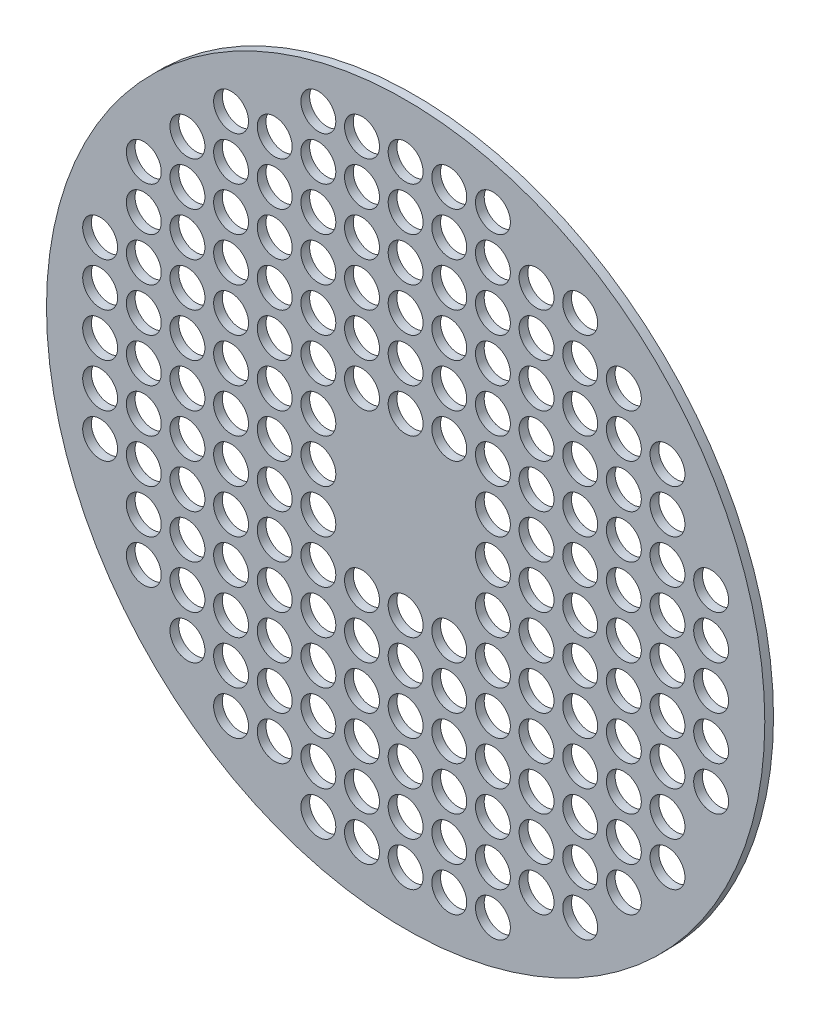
from build123d import *

# Parameters (mm, degrees)
SKETCH2_W                = 25.4
SKETCH2_H                = 25.4
EXTRUDE1_DEPTH           = 0.254
SKETCH3_R                = 0.508
CUT_EXTRUDE2_DEPTH       = 18.962308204
LPATTERN1_COUNT          = 8
LPATTERN1_PITCH          = 1.27
LPATTERN1_COUNT_DIR2     = 8
LPATTERN1_PITCH_DIR2     = 1.27
MIRROR1_COPY_1_SKETCH_R  = 0.508
MIRROR1_COPY_1_DEPTH     = 18.962308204
MIRROR1_COPY_2_SKETCH_R  = 0.508
MIRROR1_COPY_2_DEPTH     = 18.962308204
MIRROR1_COPY_3_SKETCH_R  = 0.508
MIRROR1_COPY_3_DEPTH     = 18.962308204
MIRROR1_COPY_4_SKETCH_R  = 0.508
MIRROR1_COPY_4_DEPTH     = 18.962308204
MIRROR1_COPY_5_SKETCH_R  = 0.508
MIRROR1_COPY_5_DEPTH     = 18.962308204
MIRROR1_COPY_6_SKETCH_R  = 0.508
MIRROR1_COPY_6_DEPTH     = 18.962308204
MIRROR1_COPY_7_SKETCH_R  = 0.508
MIRROR1_COPY_7_DEPTH     = 18.962308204
MIRROR1_COPY_8_SKETCH_R  = 0.508
MIRROR1_COPY_8_DEPTH     = 18.962308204
MIRROR1_COPY_9_SKETCH_R  = 0.508
MIRROR1_COPY_9_DEPTH     = 18.962308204
MIRROR1_COPY_10_SKETCH_R = 0.508
MIRROR1_COPY_10_DEPTH    = 18.962308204
MIRROR1_COPY_11_SKETCH_R = 0.508
MIRROR1_COPY_11_DEPTH    = 18.962308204
MIRROR1_COPY_12_SKETCH_R = 0.508
MIRROR1_COPY_12_DEPTH    = 18.962308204
MIRROR1_COPY_13_SKETCH_R = 0.508
MIRROR1_COPY_13_DEPTH    = 18.962308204
MIRROR1_COPY_14_SKETCH_R = 0.508
MIRROR1_COPY_14_DEPTH    = 18.962308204
MIRROR1_COPY_15_SKETCH_R = 0.508
MIRROR1_COPY_15_DEPTH    = 18.962308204
MIRROR1_COPY_16_SKETCH_R = 0.508
MIRROR1_COPY_16_DEPTH    = 18.962308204
MIRROR1_COPY_17_SKETCH_R = 0.508
MIRROR1_COPY_17_DEPTH    = 18.962308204
MIRROR1_COPY_18_SKETCH_R = 0.508
MIRROR1_COPY_18_DEPTH    = 18.962308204
MIRROR1_COPY_19_SKETCH_R = 0.508
MIRROR1_COPY_19_DEPTH    = 18.962308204
MIRROR1_COPY_20_SKETCH_R = 0.508
MIRROR1_COPY_20_DEPTH    = 18.962308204
MIRROR1_COPY_21_SKETCH_R = 0.508
MIRROR1_COPY_21_DEPTH    = 18.962308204
MIRROR1_COPY_22_SKETCH_R = 0.508
MIRROR1_COPY_22_DEPTH    = 18.962308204
MIRROR1_COPY_23_SKETCH_R = 0.508
MIRROR1_COPY_23_DEPTH    = 18.962308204
MIRROR1_COPY_24_SKETCH_R = 0.508
MIRROR1_COPY_24_DEPTH    = 18.962308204
MIRROR1_COPY_25_SKETCH_R = 0.508
MIRROR1_COPY_25_DEPTH    = 18.962308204
MIRROR1_COPY_26_SKETCH_R = 0.508
MIRROR1_COPY_26_DEPTH    = 18.962308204
MIRROR1_COPY_27_SKETCH_R = 0.508
MIRROR1_COPY_27_DEPTH    = 18.962308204
MIRROR1_COPY_28_SKETCH_R = 0.508
MIRROR1_COPY_28_DEPTH    = 18.962308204
MIRROR1_COPY_29_SKETCH_R = 0.508
MIRROR1_COPY_29_DEPTH    = 18.962308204
MIRROR1_COPY_30_SKETCH_R = 0.508
MIRROR1_COPY_30_DEPTH    = 18.962308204
MIRROR1_COPY_31_SKETCH_R = 0.508
MIRROR1_COPY_31_DEPTH    = 18.962308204
MIRROR1_COPY_32_SKETCH_R = 0.508
MIRROR1_COPY_32_DEPTH    = 18.962308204
MIRROR1_COPY_33_SKETCH_R = 0.508
MIRROR1_COPY_33_DEPTH    = 18.962308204
MIRROR1_COPY_34_SKETCH_R = 0.508
MIRROR1_COPY_34_DEPTH    = 18.962308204
MIRROR1_COPY_35_SKETCH_R = 0.508
MIRROR1_COPY_35_DEPTH    = 18.962308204
MIRROR1_COPY_36_SKETCH_R = 0.508
MIRROR1_COPY_36_DEPTH    = 18.962308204
MIRROR1_COPY_37_SKETCH_R = 0.508
MIRROR1_COPY_37_DEPTH    = 18.962308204
MIRROR1_COPY_38_SKETCH_R = 0.508
MIRROR1_COPY_38_DEPTH    = 18.962308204
MIRROR1_COPY_39_SKETCH_R = 0.508
MIRROR1_COPY_39_DEPTH    = 18.962308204
MIRROR1_COPY_40_SKETCH_R = 0.508
MIRROR1_COPY_40_DEPTH    = 18.962308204
MIRROR1_COPY_41_SKETCH_R = 0.508
MIRROR1_COPY_41_DEPTH    = 18.962308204
MIRROR1_COPY_42_SKETCH_R = 0.508
MIRROR1_COPY_42_DEPTH    = 18.962308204
MIRROR1_COPY_43_SKETCH_R = 0.508
MIRROR1_COPY_43_DEPTH    = 18.962308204
MIRROR1_COPY_44_SKETCH_R = 0.508
MIRROR1_COPY_44_DEPTH    = 18.962308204
MIRROR1_COPY_45_SKETCH_R = 0.508
MIRROR1_COPY_45_DEPTH    = 18.962308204
MIRROR1_COPY_46_SKETCH_R = 0.508
MIRROR1_COPY_46_DEPTH    = 18.962308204
MIRROR1_COPY_47_SKETCH_R = 0.508
MIRROR1_COPY_47_DEPTH    = 18.962308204
MIRROR1_COPY_48_SKETCH_R = 0.508
MIRROR1_COPY_48_DEPTH    = 18.962308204
MIRROR1_COPY_49_SKETCH_R = 0.508
MIRROR1_COPY_49_DEPTH    = 18.962308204
MIRROR2_COPY_1_SKETCH_R  = 0.508
MIRROR2_COPY_1_DEPTH     = 18.962308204
MIRROR2_COPY_2_SKETCH_R  = 0.508
MIRROR2_COPY_2_DEPTH     = 18.962308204
MIRROR2_COPY_3_SKETCH_R  = 0.508
MIRROR2_COPY_3_DEPTH     = 18.962308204
MIRROR2_COPY_4_SKETCH_R  = 0.508
MIRROR2_COPY_4_DEPTH     = 18.962308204
MIRROR2_COPY_5_SKETCH_R  = 0.508
MIRROR2_COPY_5_DEPTH     = 18.962308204
MIRROR2_COPY_6_SKETCH_R  = 0.508
MIRROR2_COPY_6_DEPTH     = 18.962308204
MIRROR2_COPY_7_SKETCH_R  = 0.508
MIRROR2_COPY_7_DEPTH     = 18.962308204
MIRROR2_COPY_8_SKETCH_R  = 0.508
MIRROR2_COPY_8_DEPTH     = 18.962308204
MIRROR2_COPY_9_SKETCH_R  = 0.508
MIRROR2_COPY_9_DEPTH     = 18.962308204
MIRROR2_COPY_10_SKETCH_R = 0.508
MIRROR2_COPY_10_DEPTH    = 18.962308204
MIRROR2_COPY_11_SKETCH_R = 0.508
MIRROR2_COPY_11_DEPTH    = 18.962308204
MIRROR2_COPY_12_SKETCH_R = 0.508
MIRROR2_COPY_12_DEPTH    = 18.962308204
MIRROR2_COPY_13_SKETCH_R = 0.508
MIRROR2_COPY_13_DEPTH    = 18.962308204
MIRROR2_COPY_14_SKETCH_R = 0.508
MIRROR2_COPY_14_DEPTH    = 18.962308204
MIRROR2_COPY_15_SKETCH_R = 0.508
MIRROR2_COPY_15_DEPTH    = 18.962308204
MIRROR2_COPY_16_SKETCH_R = 0.508
MIRROR2_COPY_16_DEPTH    = 18.962308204
MIRROR2_COPY_17_SKETCH_R = 0.508
MIRROR2_COPY_17_DEPTH    = 18.962308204
MIRROR2_COPY_18_SKETCH_R = 0.508
MIRROR2_COPY_18_DEPTH    = 18.962308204
MIRROR2_COPY_19_SKETCH_R = 0.508
MIRROR2_COPY_19_DEPTH    = 18.962308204
MIRROR2_COPY_20_SKETCH_R = 0.508
MIRROR2_COPY_20_DEPTH    = 18.962308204
MIRROR2_COPY_21_SKETCH_R = 0.508
MIRROR2_COPY_21_DEPTH    = 18.962308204
MIRROR2_COPY_22_SKETCH_R = 0.508
MIRROR2_COPY_22_DEPTH    = 18.962308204
MIRROR2_COPY_23_SKETCH_R = 0.508
MIRROR2_COPY_23_DEPTH    = 18.962308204
MIRROR2_COPY_24_SKETCH_R = 0.508
MIRROR2_COPY_24_DEPTH    = 18.962308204
MIRROR2_COPY_25_SKETCH_R = 0.508
MIRROR2_COPY_25_DEPTH    = 18.962308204
MIRROR2_COPY_26_SKETCH_R = 0.508
MIRROR2_COPY_26_DEPTH    = 18.962308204
MIRROR2_COPY_27_SKETCH_R = 0.508
MIRROR2_COPY_27_DEPTH    = 18.962308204
MIRROR2_COPY_28_SKETCH_R = 0.508
MIRROR2_COPY_28_DEPTH    = 18.962308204
MIRROR2_COPY_29_SKETCH_R = 0.508
MIRROR2_COPY_29_DEPTH    = 18.962308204
MIRROR2_COPY_30_SKETCH_R = 0.508
MIRROR2_COPY_30_DEPTH    = 18.962308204
MIRROR2_COPY_31_SKETCH_R = 0.508
MIRROR2_COPY_31_DEPTH    = 18.962308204
MIRROR2_COPY_32_SKETCH_R = 0.508
MIRROR2_COPY_32_DEPTH    = 18.962308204
MIRROR2_COPY_33_SKETCH_R = 0.508
MIRROR2_COPY_33_DEPTH    = 18.962308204
MIRROR2_COPY_34_SKETCH_R = 0.508
MIRROR2_COPY_34_DEPTH    = 18.962308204
MIRROR2_COPY_35_SKETCH_R = 0.508
MIRROR2_COPY_35_DEPTH    = 18.962308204
MIRROR2_COPY_36_SKETCH_R = 0.508
MIRROR2_COPY_36_DEPTH    = 18.962308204
MIRROR2_COPY_37_SKETCH_R = 0.508
MIRROR2_COPY_37_DEPTH    = 18.962308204
MIRROR2_COPY_38_SKETCH_R = 0.508
MIRROR2_COPY_38_DEPTH    = 18.962308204
MIRROR2_COPY_39_SKETCH_R = 0.508
MIRROR2_COPY_39_DEPTH    = 18.962308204
MIRROR2_COPY_40_SKETCH_R = 0.508
MIRROR2_COPY_40_DEPTH    = 18.962308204
MIRROR2_COPY_41_SKETCH_R = 0.508
MIRROR2_COPY_41_DEPTH    = 18.962308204
MIRROR2_COPY_42_SKETCH_R = 0.508
MIRROR2_COPY_42_DEPTH    = 18.962308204
MIRROR2_COPY_43_SKETCH_R = 0.508
MIRROR2_COPY_43_DEPTH    = 18.962308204
MIRROR2_COPY_44_SKETCH_R = 0.508
MIRROR2_COPY_44_DEPTH    = 18.962308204
MIRROR2_COPY_45_SKETCH_R = 0.508
MIRROR2_COPY_45_DEPTH    = 18.962308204
MIRROR2_COPY_46_SKETCH_R = 0.508
MIRROR2_COPY_46_DEPTH    = 18.962308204
MIRROR2_COPY_47_SKETCH_R = 0.508
MIRROR2_COPY_47_DEPTH    = 18.962308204
MIRROR2_COPY_48_SKETCH_R = 0.508
MIRROR2_COPY_48_DEPTH    = 18.962308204
MIRROR2_COPY_49_SKETCH_R = 0.508
MIRROR2_COPY_49_DEPTH    = 18.962308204
MIRROR2_COPY_50_SKETCH_R = 0.508
MIRROR2_COPY_50_DEPTH    = 18.962308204
MIRROR2_COPY_51_SKETCH_R = 0.508
MIRROR2_COPY_51_DEPTH    = 18.962308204
MIRROR2_COPY_52_SKETCH_R = 0.508
MIRROR2_COPY_52_DEPTH    = 18.962308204
MIRROR2_COPY_53_SKETCH_R = 0.508
MIRROR2_COPY_53_DEPTH    = 18.962308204
MIRROR2_COPY_54_SKETCH_R = 0.508
MIRROR2_COPY_54_DEPTH    = 18.962308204
MIRROR2_COPY_55_SKETCH_R = 0.508
MIRROR2_COPY_55_DEPTH    = 18.962308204
MIRROR2_COPY_56_SKETCH_R = 0.508
MIRROR2_COPY_56_DEPTH    = 18.962308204
MIRROR2_COPY_57_SKETCH_R = 0.508
MIRROR2_COPY_57_DEPTH    = 18.962308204
MIRROR2_COPY_58_SKETCH_R = 0.508
MIRROR2_COPY_58_DEPTH    = 18.962308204
MIRROR2_COPY_59_SKETCH_R = 0.508
MIRROR2_COPY_59_DEPTH    = 18.962308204
MIRROR2_COPY_60_SKETCH_R = 0.508
MIRROR2_COPY_60_DEPTH    = 18.962308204
MIRROR2_COPY_61_SKETCH_R = 0.508
MIRROR2_COPY_61_DEPTH    = 18.962308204
MIRROR2_COPY_62_SKETCH_R = 0.508
MIRROR2_COPY_62_DEPTH    = 18.962308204
MIRROR2_COPY_63_SKETCH_R = 0.508
MIRROR2_COPY_63_DEPTH    = 18.962308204
MIRROR2_COPY_64_SKETCH_R = 0.508
MIRROR2_COPY_64_DEPTH    = 18.962308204
MIRROR2_COPY_65_SKETCH_R = 0.508
MIRROR2_COPY_65_DEPTH    = 18.962308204
MIRROR2_COPY_66_SKETCH_R = 0.508
MIRROR2_COPY_66_DEPTH    = 18.962308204
MIRROR2_COPY_67_SKETCH_R = 0.508
MIRROR2_COPY_67_DEPTH    = 18.962308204
MIRROR2_COPY_68_SKETCH_R = 0.508
MIRROR2_COPY_68_DEPTH    = 18.962308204
MIRROR2_COPY_69_SKETCH_R = 0.508
MIRROR2_COPY_69_DEPTH    = 18.962308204
MIRROR2_COPY_70_SKETCH_R = 0.508
MIRROR2_COPY_70_DEPTH    = 18.962308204
MIRROR2_COPY_71_SKETCH_R = 0.508
MIRROR2_COPY_71_DEPTH    = 18.962308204
MIRROR2_COPY_72_SKETCH_R = 0.508
MIRROR2_COPY_72_DEPTH    = 18.962308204
MIRROR2_COPY_73_SKETCH_R = 0.508
MIRROR2_COPY_73_DEPTH    = 18.962308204
MIRROR2_COPY_74_SKETCH_R = 0.508
MIRROR2_COPY_74_DEPTH    = 18.962308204
MIRROR2_COPY_75_SKETCH_R = 0.508
MIRROR2_COPY_75_DEPTH    = 18.962308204
MIRROR2_COPY_76_SKETCH_R = 0.508
MIRROR2_COPY_76_DEPTH    = 18.962308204
MIRROR2_COPY_77_SKETCH_R = 0.508
MIRROR2_COPY_77_DEPTH    = 18.962308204
MIRROR2_COPY_78_SKETCH_R = 0.508
MIRROR2_COPY_78_DEPTH    = 18.962308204
MIRROR2_COPY_79_SKETCH_R = 0.508
MIRROR2_COPY_79_DEPTH    = 18.962308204
MIRROR2_COPY_80_SKETCH_R = 0.508
MIRROR2_COPY_80_DEPTH    = 18.962308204
MIRROR2_COPY_81_SKETCH_R = 0.508
MIRROR2_COPY_81_DEPTH    = 18.962308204
MIRROR2_COPY_82_SKETCH_R = 0.508
MIRROR2_COPY_82_DEPTH    = 18.962308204
MIRROR2_COPY_83_SKETCH_R = 0.508
MIRROR2_COPY_83_DEPTH    = 18.962308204
MIRROR2_COPY_84_SKETCH_R = 0.508
MIRROR2_COPY_84_DEPTH    = 18.962308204
MIRROR2_COPY_85_SKETCH_R = 0.508
MIRROR2_COPY_85_DEPTH    = 18.962308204
MIRROR2_COPY_86_SKETCH_R = 0.508
MIRROR2_COPY_86_DEPTH    = 18.962308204
MIRROR2_COPY_87_SKETCH_R = 0.508
MIRROR2_COPY_87_DEPTH    = 18.962308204
MIRROR2_COPY_88_SKETCH_R = 0.508
MIRROR2_COPY_88_DEPTH    = 18.962308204
MIRROR2_COPY_89_SKETCH_R = 0.508
MIRROR2_COPY_89_DEPTH    = 18.962308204
MIRROR2_COPY_90_SKETCH_R = 0.508
MIRROR2_COPY_90_DEPTH    = 18.962308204
MIRROR2_COPY_91_SKETCH_R = 0.508
MIRROR2_COPY_91_DEPTH    = 18.962308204
MIRROR2_COPY_92_SKETCH_R = 0.508
MIRROR2_COPY_92_DEPTH    = 18.962308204
MIRROR2_COPY_93_SKETCH_R = 0.508
MIRROR2_COPY_93_DEPTH    = 18.962308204
MIRROR2_COPY_94_SKETCH_R = 0.508
MIRROR2_COPY_94_DEPTH    = 18.962308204
MIRROR2_COPY_95_SKETCH_R = 0.508
MIRROR2_COPY_95_DEPTH    = 18.962308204
MIRROR2_COPY_96_SKETCH_R = 0.508
MIRROR2_COPY_96_DEPTH    = 18.962308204
MIRROR2_COPY_97_SKETCH_R = 0.508
MIRROR2_COPY_97_DEPTH    = 18.962308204
MIRROR2_COPY_98_SKETCH_R = 0.508
MIRROR2_COPY_98_DEPTH    = 18.962308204
MIRROR2_COPY_99_SKETCH_R = 0.508
MIRROR2_COPY_99_DEPTH    = 18.962308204
SKETCH4_OUTSIDE_W        = 34.584
SKETCH4_OUTSIDE_H        = 34.584
SKETCH4_OUTSIDE_R        = 10.4521
CUT_EXTRUDE4_DEPTH       = 18.962308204
SKETCH5_R                = 10.4521
SKETCH5_R_2              = 9.8298
EXTRUDE2_DEPTH           = 0.127
SKETCH6_R                = 1.905
EXTRUDE4_DEPTH           = 0.254


with BuildPart() as part:
    # Sketch2 → Extrude1 (new body)
    with BuildSketch(Plane.XY):
        Rectangle(SKETCH2_W, SKETCH2_H)
    extrude(amount=EXTRUDE1_DEPTH)

    # Sketch3 → Cut-Extrude2 (cut, through all)
    with BuildSketch(Plane.XY):
        Circle(SKETCH3_R)
    cut_extrude2 = extrude(amount=CUT_EXTRUDE2_DEPTH, mode=Mode.SUBTRACT)

    # LPattern1: Cut-Extrude2 8 × 8, 15 skipped
    with Locations(*[(-j * LPATTERN1_PITCH_DIR2, i * LPATTERN1_PITCH, 0) for i in range(LPATTERN1_COUNT) for j in range(LPATTERN1_COUNT_DIR2) if (i, j) not in ((0, 0), (0, 1), (1, 0), (1, 1), (3, 7), (4, 7), (5, 6), (5, 7), (6, 5), (6, 6), (6, 7), (7, 3), (7, 4), (7, 5), (7, 6), (7, 7))]):
        add(cut_extrude2, mode=Mode.SUBTRACT)

    # Mirror1 copy 1 sketch → Mirror1 copy 1 (cut, through all)
    with BuildSketch(Plane(origin=(-2.54, 0, 0), x_dir=(1, 0, 0), z_dir=(0, 0, 1))):
        Circle(MIRROR1_COPY_1_SKETCH_R)
    extrude(amount=MIRROR1_COPY_1_DEPTH, mode=Mode.SUBTRACT)

    # Mirror1 copy 2 sketch → Mirror1 copy 2 (cut, through all)
    with BuildSketch(Plane(origin=(-3.81, 0, 0), x_dir=(1, 0, 0), z_dir=(0, 0, 1))):
        Circle(MIRROR1_COPY_2_SKETCH_R)
    extrude(amount=MIRROR1_COPY_2_DEPTH, mode=Mode.SUBTRACT)

    # Mirror1 copy 3 sketch → Mirror1 copy 3 (cut, through all)
    with BuildSketch(Plane(origin=(-5.08, 0, 0), x_dir=(1, 0, 0), z_dir=(0, 0, 1))):
        Circle(MIRROR1_COPY_3_SKETCH_R)
    extrude(amount=MIRROR1_COPY_3_DEPTH, mode=Mode.SUBTRACT)

    # Mirror1 copy 4 sketch → Mirror1 copy 4 (cut, through all)
    with BuildSketch(Plane(origin=(-6.35, 0, 0), x_dir=(1, 0, 0), z_dir=(0, 0, 1))):
        Circle(MIRROR1_COPY_4_SKETCH_R)
    extrude(amount=MIRROR1_COPY_4_DEPTH, mode=Mode.SUBTRACT)

    # Mirror1 copy 5 sketch → Mirror1 copy 5 (cut, through all)
    with BuildSketch(Plane(origin=(-7.62, 0, 0), x_dir=(1, 0, 0), z_dir=(0, 0, 1))):
        Circle(MIRROR1_COPY_5_SKETCH_R)
    extrude(amount=MIRROR1_COPY_5_DEPTH, mode=Mode.SUBTRACT)

    # Mirror1 copy 6 sketch → Mirror1 copy 6 (cut, through all)
    with BuildSketch(Plane(origin=(-8.89, 0, 0), x_dir=(1, 0, 0), z_dir=(0, 0, 1))):
        Circle(MIRROR1_COPY_6_SKETCH_R)
    extrude(amount=MIRROR1_COPY_6_DEPTH, mode=Mode.SUBTRACT)

    # Mirror1 copy 7 sketch → Mirror1 copy 7 (cut, through all)
    with BuildSketch(Plane(origin=(-2.54, -1.27, 0), x_dir=(1, 0, 0), z_dir=(0, 0, 1))):
        Circle(MIRROR1_COPY_7_SKETCH_R)
    extrude(amount=MIRROR1_COPY_7_DEPTH, mode=Mode.SUBTRACT)

    # Mirror1 copy 8 sketch → Mirror1 copy 8 (cut, through all)
    with BuildSketch(Plane(origin=(-3.81, -1.27, 0), x_dir=(1, 0, 0), z_dir=(0, 0, 1))):
        Circle(MIRROR1_COPY_8_SKETCH_R)
    extrude(amount=MIRROR1_COPY_8_DEPTH, mode=Mode.SUBTRACT)

    # Mirror1 copy 9 sketch → Mirror1 copy 9 (cut, through all)
    with BuildSketch(Plane(origin=(-5.08, -1.27, 0), x_dir=(1, 0, 0), z_dir=(0, 0, 1))):
        Circle(MIRROR1_COPY_9_SKETCH_R)
    extrude(amount=MIRROR1_COPY_9_DEPTH, mode=Mode.SUBTRACT)

    # Mirror1 copy 10 sketch → Mirror1 copy 10 (cut, through all)
    with BuildSketch(Plane(origin=(-6.35, -1.27, 0), x_dir=(1, 0, 0), z_dir=(0, 0, 1))):
        Circle(MIRROR1_COPY_10_SKETCH_R)
    extrude(amount=MIRROR1_COPY_10_DEPTH, mode=Mode.SUBTRACT)

    # Mirror1 copy 11 sketch → Mirror1 copy 11 (cut, through all)
    with BuildSketch(Plane(origin=(-7.62, -1.27, 0), x_dir=(1, 0, 0), z_dir=(0, 0, 1))):
        Circle(MIRROR1_COPY_11_SKETCH_R)
    extrude(amount=MIRROR1_COPY_11_DEPTH, mode=Mode.SUBTRACT)

    # Mirror1 copy 12 sketch → Mirror1 copy 12 (cut, through all)
    with BuildSketch(Plane(origin=(-8.89, -1.27, 0), x_dir=(1, 0, 0), z_dir=(0, 0, 1))):
        Circle(MIRROR1_COPY_12_SKETCH_R)
    extrude(amount=MIRROR1_COPY_12_DEPTH, mode=Mode.SUBTRACT)

    # Mirror1 copy 13 sketch → Mirror1 copy 13 (cut, through all)
    with BuildSketch(Plane(origin=(0, -2.54, 0), x_dir=(1, 0, 0), z_dir=(0, 0, 1))):
        Circle(MIRROR1_COPY_13_SKETCH_R)
    extrude(amount=MIRROR1_COPY_13_DEPTH, mode=Mode.SUBTRACT)

    # Mirror1 copy 14 sketch → Mirror1 copy 14 (cut, through all)
    with BuildSketch(Plane(origin=(-1.27, -2.54, 0), x_dir=(1, 0, 0), z_dir=(0, 0, 1))):
        Circle(MIRROR1_COPY_14_SKETCH_R)
    extrude(amount=MIRROR1_COPY_14_DEPTH, mode=Mode.SUBTRACT)

    # Mirror1 copy 15 sketch → Mirror1 copy 15 (cut, through all)
    with BuildSketch(Plane(origin=(-2.54, -2.54, 0), x_dir=(1, 0, 0), z_dir=(0, 0, 1))):
        Circle(MIRROR1_COPY_15_SKETCH_R)
    extrude(amount=MIRROR1_COPY_15_DEPTH, mode=Mode.SUBTRACT)

    # Mirror1 copy 16 sketch → Mirror1 copy 16 (cut, through all)
    with BuildSketch(Plane(origin=(-3.81, -2.54, 0), x_dir=(1, 0, 0), z_dir=(0, 0, 1))):
        Circle(MIRROR1_COPY_16_SKETCH_R)
    extrude(amount=MIRROR1_COPY_16_DEPTH, mode=Mode.SUBTRACT)

    # Mirror1 copy 17 sketch → Mirror1 copy 17 (cut, through all)
    with BuildSketch(Plane(origin=(-5.08, -2.54, 0), x_dir=(1, 0, 0), z_dir=(0, 0, 1))):
        Circle(MIRROR1_COPY_17_SKETCH_R)
    extrude(amount=MIRROR1_COPY_17_DEPTH, mode=Mode.SUBTRACT)

    # Mirror1 copy 18 sketch → Mirror1 copy 18 (cut, through all)
    with BuildSketch(Plane(origin=(-6.35, -2.54, 0), x_dir=(1, 0, 0), z_dir=(0, 0, 1))):
        Circle(MIRROR1_COPY_18_SKETCH_R)
    extrude(amount=MIRROR1_COPY_18_DEPTH, mode=Mode.SUBTRACT)

    # Mirror1 copy 19 sketch → Mirror1 copy 19 (cut, through all)
    with BuildSketch(Plane(origin=(-7.62, -2.54, 0), x_dir=(1, 0, 0), z_dir=(0, 0, 1))):
        Circle(MIRROR1_COPY_19_SKETCH_R)
    extrude(amount=MIRROR1_COPY_19_DEPTH, mode=Mode.SUBTRACT)

    # Mirror1 copy 20 sketch → Mirror1 copy 20 (cut, through all)
    with BuildSketch(Plane(origin=(-8.89, -2.54, 0), x_dir=(1, 0, 0), z_dir=(0, 0, 1))):
        Circle(MIRROR1_COPY_20_SKETCH_R)
    extrude(amount=MIRROR1_COPY_20_DEPTH, mode=Mode.SUBTRACT)

    # Mirror1 copy 21 sketch → Mirror1 copy 21 (cut, through all)
    with BuildSketch(Plane(origin=(0, -3.81, 0), x_dir=(1, 0, 0), z_dir=(0, 0, 1))):
        Circle(MIRROR1_COPY_21_SKETCH_R)
    extrude(amount=MIRROR1_COPY_21_DEPTH, mode=Mode.SUBTRACT)

    # Mirror1 copy 22 sketch → Mirror1 copy 22 (cut, through all)
    with BuildSketch(Plane(origin=(-1.27, -3.81, 0), x_dir=(1, 0, 0), z_dir=(0, 0, 1))):
        Circle(MIRROR1_COPY_22_SKETCH_R)
    extrude(amount=MIRROR1_COPY_22_DEPTH, mode=Mode.SUBTRACT)

    # Mirror1 copy 23 sketch → Mirror1 copy 23 (cut, through all)
    with BuildSketch(Plane(origin=(-2.54, -3.81, 0), x_dir=(1, 0, 0), z_dir=(0, 0, 1))):
        Circle(MIRROR1_COPY_23_SKETCH_R)
    extrude(amount=MIRROR1_COPY_23_DEPTH, mode=Mode.SUBTRACT)

    # Mirror1 copy 24 sketch → Mirror1 copy 24 (cut, through all)
    with BuildSketch(Plane(origin=(-3.81, -3.81, 0), x_dir=(1, 0, 0), z_dir=(0, 0, 1))):
        Circle(MIRROR1_COPY_24_SKETCH_R)
    extrude(amount=MIRROR1_COPY_24_DEPTH, mode=Mode.SUBTRACT)

    # Mirror1 copy 25 sketch → Mirror1 copy 25 (cut, through all)
    with BuildSketch(Plane(origin=(-5.08, -3.81, 0), x_dir=(1, 0, 0), z_dir=(0, 0, 1))):
        Circle(MIRROR1_COPY_25_SKETCH_R)
    extrude(amount=MIRROR1_COPY_25_DEPTH, mode=Mode.SUBTRACT)

    # Mirror1 copy 26 sketch → Mirror1 copy 26 (cut, through all)
    with BuildSketch(Plane(origin=(-6.35, -3.81, 0), x_dir=(1, 0, 0), z_dir=(0, 0, 1))):
        Circle(MIRROR1_COPY_26_SKETCH_R)
    extrude(amount=MIRROR1_COPY_26_DEPTH, mode=Mode.SUBTRACT)

    # Mirror1 copy 27 sketch → Mirror1 copy 27 (cut, through all)
    with BuildSketch(Plane(origin=(-7.62, -3.81, 0), x_dir=(1, 0, 0), z_dir=(0, 0, 1))):
        Circle(MIRROR1_COPY_27_SKETCH_R)
    extrude(amount=MIRROR1_COPY_27_DEPTH, mode=Mode.SUBTRACT)

    # Mirror1 copy 28 sketch → Mirror1 copy 28 (cut, through all)
    with BuildSketch(Plane(origin=(0, -5.08, 0), x_dir=(1, 0, 0), z_dir=(0, 0, 1))):
        Circle(MIRROR1_COPY_28_SKETCH_R)
    extrude(amount=MIRROR1_COPY_28_DEPTH, mode=Mode.SUBTRACT)

    # Mirror1 copy 29 sketch → Mirror1 copy 29 (cut, through all)
    with BuildSketch(Plane(origin=(-1.27, -5.08, 0), x_dir=(1, 0, 0), z_dir=(0, 0, 1))):
        Circle(MIRROR1_COPY_29_SKETCH_R)
    extrude(amount=MIRROR1_COPY_29_DEPTH, mode=Mode.SUBTRACT)

    # Mirror1 copy 30 sketch → Mirror1 copy 30 (cut, through all)
    with BuildSketch(Plane(origin=(-2.54, -5.08, 0), x_dir=(1, 0, 0), z_dir=(0, 0, 1))):
        Circle(MIRROR1_COPY_30_SKETCH_R)
    extrude(amount=MIRROR1_COPY_30_DEPTH, mode=Mode.SUBTRACT)

    # Mirror1 copy 31 sketch → Mirror1 copy 31 (cut, through all)
    with BuildSketch(Plane(origin=(-3.81, -5.08, 0), x_dir=(1, 0, 0), z_dir=(0, 0, 1))):
        Circle(MIRROR1_COPY_31_SKETCH_R)
    extrude(amount=MIRROR1_COPY_31_DEPTH, mode=Mode.SUBTRACT)

    # Mirror1 copy 32 sketch → Mirror1 copy 32 (cut, through all)
    with BuildSketch(Plane(origin=(-5.08, -5.08, 0), x_dir=(1, 0, 0), z_dir=(0, 0, 1))):
        Circle(MIRROR1_COPY_32_SKETCH_R)
    extrude(amount=MIRROR1_COPY_32_DEPTH, mode=Mode.SUBTRACT)

    # Mirror1 copy 33 sketch → Mirror1 copy 33 (cut, through all)
    with BuildSketch(Plane(origin=(-6.35, -5.08, 0), x_dir=(1, 0, 0), z_dir=(0, 0, 1))):
        Circle(MIRROR1_COPY_33_SKETCH_R)
    extrude(amount=MIRROR1_COPY_33_DEPTH, mode=Mode.SUBTRACT)

    # Mirror1 copy 34 sketch → Mirror1 copy 34 (cut, through all)
    with BuildSketch(Plane(origin=(-7.62, -5.08, 0), x_dir=(1, 0, 0), z_dir=(0, 0, 1))):
        Circle(MIRROR1_COPY_34_SKETCH_R)
    extrude(amount=MIRROR1_COPY_34_DEPTH, mode=Mode.SUBTRACT)

    # Mirror1 copy 35 sketch → Mirror1 copy 35 (cut, through all)
    with BuildSketch(Plane(origin=(0, -6.35, 0), x_dir=(1, 0, 0), z_dir=(0, 0, 1))):
        Circle(MIRROR1_COPY_35_SKETCH_R)
    extrude(amount=MIRROR1_COPY_35_DEPTH, mode=Mode.SUBTRACT)

    # Mirror1 copy 36 sketch → Mirror1 copy 36 (cut, through all)
    with BuildSketch(Plane(origin=(-1.27, -6.35, 0), x_dir=(1, 0, 0), z_dir=(0, 0, 1))):
        Circle(MIRROR1_COPY_36_SKETCH_R)
    extrude(amount=MIRROR1_COPY_36_DEPTH, mode=Mode.SUBTRACT)

    # Mirror1 copy 37 sketch → Mirror1 copy 37 (cut, through all)
    with BuildSketch(Plane(origin=(-2.54, -6.35, 0), x_dir=(1, 0, 0), z_dir=(0, 0, 1))):
        Circle(MIRROR1_COPY_37_SKETCH_R)
    extrude(amount=MIRROR1_COPY_37_DEPTH, mode=Mode.SUBTRACT)

    # Mirror1 copy 38 sketch → Mirror1 copy 38 (cut, through all)
    with BuildSketch(Plane(origin=(-3.81, -6.35, 0), x_dir=(1, 0, 0), z_dir=(0, 0, 1))):
        Circle(MIRROR1_COPY_38_SKETCH_R)
    extrude(amount=MIRROR1_COPY_38_DEPTH, mode=Mode.SUBTRACT)

    # Mirror1 copy 39 sketch → Mirror1 copy 39 (cut, through all)
    with BuildSketch(Plane(origin=(-5.08, -6.35, 0), x_dir=(1, 0, 0), z_dir=(0, 0, 1))):
        Circle(MIRROR1_COPY_39_SKETCH_R)
    extrude(amount=MIRROR1_COPY_39_DEPTH, mode=Mode.SUBTRACT)

    # Mirror1 copy 40 sketch → Mirror1 copy 40 (cut, through all)
    with BuildSketch(Plane(origin=(-6.35, -6.35, 0), x_dir=(1, 0, 0), z_dir=(0, 0, 1))):
        Circle(MIRROR1_COPY_40_SKETCH_R)
    extrude(amount=MIRROR1_COPY_40_DEPTH, mode=Mode.SUBTRACT)

    # Mirror1 copy 41 sketch → Mirror1 copy 41 (cut, through all)
    with BuildSketch(Plane(origin=(0, -7.62, 0), x_dir=(1, 0, 0), z_dir=(0, 0, 1))):
        Circle(MIRROR1_COPY_41_SKETCH_R)
    extrude(amount=MIRROR1_COPY_41_DEPTH, mode=Mode.SUBTRACT)

    # Mirror1 copy 42 sketch → Mirror1 copy 42 (cut, through all)
    with BuildSketch(Plane(origin=(-1.27, -7.62, 0), x_dir=(1, 0, 0), z_dir=(0, 0, 1))):
        Circle(MIRROR1_COPY_42_SKETCH_R)
    extrude(amount=MIRROR1_COPY_42_DEPTH, mode=Mode.SUBTRACT)

    # Mirror1 copy 43 sketch → Mirror1 copy 43 (cut, through all)
    with BuildSketch(Plane(origin=(-2.54, -7.62, 0), x_dir=(1, 0, 0), z_dir=(0, 0, 1))):
        Circle(MIRROR1_COPY_43_SKETCH_R)
    extrude(amount=MIRROR1_COPY_43_DEPTH, mode=Mode.SUBTRACT)

    # Mirror1 copy 44 sketch → Mirror1 copy 44 (cut, through all)
    with BuildSketch(Plane(origin=(-3.81, -7.62, 0), x_dir=(1, 0, 0), z_dir=(0, 0, 1))):
        Circle(MIRROR1_COPY_44_SKETCH_R)
    extrude(amount=MIRROR1_COPY_44_DEPTH, mode=Mode.SUBTRACT)

    # Mirror1 copy 45 sketch → Mirror1 copy 45 (cut, through all)
    with BuildSketch(Plane(origin=(-5.08, -7.62, 0), x_dir=(1, 0, 0), z_dir=(0, 0, 1))):
        Circle(MIRROR1_COPY_45_SKETCH_R)
    extrude(amount=MIRROR1_COPY_45_DEPTH, mode=Mode.SUBTRACT)

    # Mirror1 copy 46 sketch → Mirror1 copy 46 (cut, through all)
    with BuildSketch(Plane(origin=(0, -8.89, 0), x_dir=(1, 0, 0), z_dir=(0, 0, 1))):
        Circle(MIRROR1_COPY_46_SKETCH_R)
    extrude(amount=MIRROR1_COPY_46_DEPTH, mode=Mode.SUBTRACT)

    # Mirror1 copy 47 sketch → Mirror1 copy 47 (cut, through all)
    with BuildSketch(Plane(origin=(-1.27, -8.89, 0), x_dir=(1, 0, 0), z_dir=(0, 0, 1))):
        Circle(MIRROR1_COPY_47_SKETCH_R)
    extrude(amount=MIRROR1_COPY_47_DEPTH, mode=Mode.SUBTRACT)

    # Mirror1 copy 48 sketch → Mirror1 copy 48 (cut, through all)
    with BuildSketch(Plane(origin=(-2.54, -8.89, 0), x_dir=(1, 0, 0), z_dir=(0, 0, 1))):
        Circle(MIRROR1_COPY_48_SKETCH_R)
    extrude(amount=MIRROR1_COPY_48_DEPTH, mode=Mode.SUBTRACT)

    # Mirror1 copy 49 sketch → Mirror1 copy 49 (cut, through all)
    with BuildSketch(Plane.XY):
        Circle(MIRROR1_COPY_49_SKETCH_R)
    extrude(amount=MIRROR1_COPY_49_DEPTH, mode=Mode.SUBTRACT)

    # Mirror2 copy 1 sketch → Mirror2 copy 1 (cut, through all)
    with BuildSketch(Plane(origin=(2.54, 0, 0), x_dir=(-1, 0, 0), z_dir=(0, 0, 1))):
        Circle(MIRROR2_COPY_1_SKETCH_R)
    extrude(amount=MIRROR2_COPY_1_DEPTH, mode=Mode.SUBTRACT)

    # Mirror2 copy 2 sketch → Mirror2 copy 2 (cut, through all)
    with BuildSketch(Plane(origin=(3.81, 0, 0), x_dir=(-1, 0, 0), z_dir=(0, 0, 1))):
        Circle(MIRROR2_COPY_2_SKETCH_R)
    extrude(amount=MIRROR2_COPY_2_DEPTH, mode=Mode.SUBTRACT)

    # Mirror2 copy 3 sketch → Mirror2 copy 3 (cut, through all)
    with BuildSketch(Plane(origin=(5.08, 0, 0), x_dir=(-1, 0, 0), z_dir=(0, 0, 1))):
        Circle(MIRROR2_COPY_3_SKETCH_R)
    extrude(amount=MIRROR2_COPY_3_DEPTH, mode=Mode.SUBTRACT)

    # Mirror2 copy 4 sketch → Mirror2 copy 4 (cut, through all)
    with BuildSketch(Plane(origin=(6.35, 0, 0), x_dir=(-1, 0, 0), z_dir=(0, 0, 1))):
        Circle(MIRROR2_COPY_4_SKETCH_R)
    extrude(amount=MIRROR2_COPY_4_DEPTH, mode=Mode.SUBTRACT)

    # Mirror2 copy 5 sketch → Mirror2 copy 5 (cut, through all)
    with BuildSketch(Plane(origin=(7.62, 0, 0), x_dir=(-1, 0, 0), z_dir=(0, 0, 1))):
        Circle(MIRROR2_COPY_5_SKETCH_R)
    extrude(amount=MIRROR2_COPY_5_DEPTH, mode=Mode.SUBTRACT)

    # Mirror2 copy 6 sketch → Mirror2 copy 6 (cut, through all)
    with BuildSketch(Plane(origin=(8.89, 0, 0), x_dir=(-1, 0, 0), z_dir=(0, 0, 1))):
        Circle(MIRROR2_COPY_6_SKETCH_R)
    extrude(amount=MIRROR2_COPY_6_DEPTH, mode=Mode.SUBTRACT)

    # Mirror2 copy 7 sketch → Mirror2 copy 7 (cut, through all)
    with BuildSketch(Plane(origin=(2.54, 1.27, 0), x_dir=(-1, 0, 0), z_dir=(0, 0, 1))):
        Circle(MIRROR2_COPY_7_SKETCH_R)
    extrude(amount=MIRROR2_COPY_7_DEPTH, mode=Mode.SUBTRACT)

    # Mirror2 copy 8 sketch → Mirror2 copy 8 (cut, through all)
    with BuildSketch(Plane(origin=(3.81, 1.27, 0), x_dir=(-1, 0, 0), z_dir=(0, 0, 1))):
        Circle(MIRROR2_COPY_8_SKETCH_R)
    extrude(amount=MIRROR2_COPY_8_DEPTH, mode=Mode.SUBTRACT)

    # Mirror2 copy 9 sketch → Mirror2 copy 9 (cut, through all)
    with BuildSketch(Plane(origin=(5.08, 1.27, 0), x_dir=(-1, 0, 0), z_dir=(0, 0, 1))):
        Circle(MIRROR2_COPY_9_SKETCH_R)
    extrude(amount=MIRROR2_COPY_9_DEPTH, mode=Mode.SUBTRACT)

    # Mirror2 copy 10 sketch → Mirror2 copy 10 (cut, through all)
    with BuildSketch(Plane(origin=(6.35, 1.27, 0), x_dir=(-1, 0, 0), z_dir=(0, 0, 1))):
        Circle(MIRROR2_COPY_10_SKETCH_R)
    extrude(amount=MIRROR2_COPY_10_DEPTH, mode=Mode.SUBTRACT)

    # Mirror2 copy 11 sketch → Mirror2 copy 11 (cut, through all)
    with BuildSketch(Plane(origin=(7.62, 1.27, 0), x_dir=(-1, 0, 0), z_dir=(0, 0, 1))):
        Circle(MIRROR2_COPY_11_SKETCH_R)
    extrude(amount=MIRROR2_COPY_11_DEPTH, mode=Mode.SUBTRACT)

    # Mirror2 copy 12 sketch → Mirror2 copy 12 (cut, through all)
    with BuildSketch(Plane(origin=(8.89, 1.27, 0), x_dir=(-1, 0, 0), z_dir=(0, 0, 1))):
        Circle(MIRROR2_COPY_12_SKETCH_R)
    extrude(amount=MIRROR2_COPY_12_DEPTH, mode=Mode.SUBTRACT)

    # Mirror2 copy 13 sketch → Mirror2 copy 13 (cut, through all)
    with BuildSketch(Plane(origin=(0, 2.54, 0), x_dir=(-1, 0, 0), z_dir=(0, 0, 1))):
        Circle(MIRROR2_COPY_13_SKETCH_R)
    extrude(amount=MIRROR2_COPY_13_DEPTH, mode=Mode.SUBTRACT)

    # Mirror2 copy 14 sketch → Mirror2 copy 14 (cut, through all)
    with BuildSketch(Plane(origin=(1.27, 2.54, 0), x_dir=(-1, 0, 0), z_dir=(0, 0, 1))):
        Circle(MIRROR2_COPY_14_SKETCH_R)
    extrude(amount=MIRROR2_COPY_14_DEPTH, mode=Mode.SUBTRACT)

    # Mirror2 copy 15 sketch → Mirror2 copy 15 (cut, through all)
    with BuildSketch(Plane(origin=(2.54, 2.54, 0), x_dir=(-1, 0, 0), z_dir=(0, 0, 1))):
        Circle(MIRROR2_COPY_15_SKETCH_R)
    extrude(amount=MIRROR2_COPY_15_DEPTH, mode=Mode.SUBTRACT)

    # Mirror2 copy 16 sketch → Mirror2 copy 16 (cut, through all)
    with BuildSketch(Plane(origin=(3.81, 2.54, 0), x_dir=(-1, 0, 0), z_dir=(0, 0, 1))):
        Circle(MIRROR2_COPY_16_SKETCH_R)
    extrude(amount=MIRROR2_COPY_16_DEPTH, mode=Mode.SUBTRACT)

    # Mirror2 copy 17 sketch → Mirror2 copy 17 (cut, through all)
    with BuildSketch(Plane(origin=(5.08, 2.54, 0), x_dir=(-1, 0, 0), z_dir=(0, 0, 1))):
        Circle(MIRROR2_COPY_17_SKETCH_R)
    extrude(amount=MIRROR2_COPY_17_DEPTH, mode=Mode.SUBTRACT)

    # Mirror2 copy 18 sketch → Mirror2 copy 18 (cut, through all)
    with BuildSketch(Plane(origin=(6.35, 2.54, 0), x_dir=(-1, 0, 0), z_dir=(0, 0, 1))):
        Circle(MIRROR2_COPY_18_SKETCH_R)
    extrude(amount=MIRROR2_COPY_18_DEPTH, mode=Mode.SUBTRACT)

    # Mirror2 copy 19 sketch → Mirror2 copy 19 (cut, through all)
    with BuildSketch(Plane(origin=(7.62, 2.54, 0), x_dir=(-1, 0, 0), z_dir=(0, 0, 1))):
        Circle(MIRROR2_COPY_19_SKETCH_R)
    extrude(amount=MIRROR2_COPY_19_DEPTH, mode=Mode.SUBTRACT)

    # Mirror2 copy 20 sketch → Mirror2 copy 20 (cut, through all)
    with BuildSketch(Plane(origin=(8.89, 2.54, 0), x_dir=(-1, 0, 0), z_dir=(0, 0, 1))):
        Circle(MIRROR2_COPY_20_SKETCH_R)
    extrude(amount=MIRROR2_COPY_20_DEPTH, mode=Mode.SUBTRACT)

    # Mirror2 copy 21 sketch → Mirror2 copy 21 (cut, through all)
    with BuildSketch(Plane(origin=(0, 3.81, 0), x_dir=(-1, 0, 0), z_dir=(0, 0, 1))):
        Circle(MIRROR2_COPY_21_SKETCH_R)
    extrude(amount=MIRROR2_COPY_21_DEPTH, mode=Mode.SUBTRACT)

    # Mirror2 copy 22 sketch → Mirror2 copy 22 (cut, through all)
    with BuildSketch(Plane(origin=(1.27, 3.81, 0), x_dir=(-1, 0, 0), z_dir=(0, 0, 1))):
        Circle(MIRROR2_COPY_22_SKETCH_R)
    extrude(amount=MIRROR2_COPY_22_DEPTH, mode=Mode.SUBTRACT)

    # Mirror2 copy 23 sketch → Mirror2 copy 23 (cut, through all)
    with BuildSketch(Plane(origin=(2.54, 3.81, 0), x_dir=(-1, 0, 0), z_dir=(0, 0, 1))):
        Circle(MIRROR2_COPY_23_SKETCH_R)
    extrude(amount=MIRROR2_COPY_23_DEPTH, mode=Mode.SUBTRACT)

    # Mirror2 copy 24 sketch → Mirror2 copy 24 (cut, through all)
    with BuildSketch(Plane(origin=(3.81, 3.81, 0), x_dir=(-1, 0, 0), z_dir=(0, 0, 1))):
        Circle(MIRROR2_COPY_24_SKETCH_R)
    extrude(amount=MIRROR2_COPY_24_DEPTH, mode=Mode.SUBTRACT)

    # Mirror2 copy 25 sketch → Mirror2 copy 25 (cut, through all)
    with BuildSketch(Plane(origin=(5.08, 3.81, 0), x_dir=(-1, 0, 0), z_dir=(0, 0, 1))):
        Circle(MIRROR2_COPY_25_SKETCH_R)
    extrude(amount=MIRROR2_COPY_25_DEPTH, mode=Mode.SUBTRACT)

    # Mirror2 copy 26 sketch → Mirror2 copy 26 (cut, through all)
    with BuildSketch(Plane(origin=(6.35, 3.81, 0), x_dir=(-1, 0, 0), z_dir=(0, 0, 1))):
        Circle(MIRROR2_COPY_26_SKETCH_R)
    extrude(amount=MIRROR2_COPY_26_DEPTH, mode=Mode.SUBTRACT)

    # Mirror2 copy 27 sketch → Mirror2 copy 27 (cut, through all)
    with BuildSketch(Plane(origin=(7.62, 3.81, 0), x_dir=(-1, 0, 0), z_dir=(0, 0, 1))):
        Circle(MIRROR2_COPY_27_SKETCH_R)
    extrude(amount=MIRROR2_COPY_27_DEPTH, mode=Mode.SUBTRACT)

    # Mirror2 copy 28 sketch → Mirror2 copy 28 (cut, through all)
    with BuildSketch(Plane(origin=(0, 5.08, 0), x_dir=(-1, 0, 0), z_dir=(0, 0, 1))):
        Circle(MIRROR2_COPY_28_SKETCH_R)
    extrude(amount=MIRROR2_COPY_28_DEPTH, mode=Mode.SUBTRACT)

    # Mirror2 copy 29 sketch → Mirror2 copy 29 (cut, through all)
    with BuildSketch(Plane(origin=(1.27, 5.08, 0), x_dir=(-1, 0, 0), z_dir=(0, 0, 1))):
        Circle(MIRROR2_COPY_29_SKETCH_R)
    extrude(amount=MIRROR2_COPY_29_DEPTH, mode=Mode.SUBTRACT)

    # Mirror2 copy 30 sketch → Mirror2 copy 30 (cut, through all)
    with BuildSketch(Plane(origin=(2.54, 5.08, 0), x_dir=(-1, 0, 0), z_dir=(0, 0, 1))):
        Circle(MIRROR2_COPY_30_SKETCH_R)
    extrude(amount=MIRROR2_COPY_30_DEPTH, mode=Mode.SUBTRACT)

    # Mirror2 copy 31 sketch → Mirror2 copy 31 (cut, through all)
    with BuildSketch(Plane(origin=(3.81, 5.08, 0), x_dir=(-1, 0, 0), z_dir=(0, 0, 1))):
        Circle(MIRROR2_COPY_31_SKETCH_R)
    extrude(amount=MIRROR2_COPY_31_DEPTH, mode=Mode.SUBTRACT)

    # Mirror2 copy 32 sketch → Mirror2 copy 32 (cut, through all)
    with BuildSketch(Plane(origin=(5.08, 5.08, 0), x_dir=(-1, 0, 0), z_dir=(0, 0, 1))):
        Circle(MIRROR2_COPY_32_SKETCH_R)
    extrude(amount=MIRROR2_COPY_32_DEPTH, mode=Mode.SUBTRACT)

    # Mirror2 copy 33 sketch → Mirror2 copy 33 (cut, through all)
    with BuildSketch(Plane(origin=(6.35, 5.08, 0), x_dir=(-1, 0, 0), z_dir=(0, 0, 1))):
        Circle(MIRROR2_COPY_33_SKETCH_R)
    extrude(amount=MIRROR2_COPY_33_DEPTH, mode=Mode.SUBTRACT)

    # Mirror2 copy 34 sketch → Mirror2 copy 34 (cut, through all)
    with BuildSketch(Plane(origin=(7.62, 5.08, 0), x_dir=(-1, 0, 0), z_dir=(0, 0, 1))):
        Circle(MIRROR2_COPY_34_SKETCH_R)
    extrude(amount=MIRROR2_COPY_34_DEPTH, mode=Mode.SUBTRACT)

    # Mirror2 copy 35 sketch → Mirror2 copy 35 (cut, through all)
    with BuildSketch(Plane(origin=(0, 6.35, 0), x_dir=(-1, 0, 0), z_dir=(0, 0, 1))):
        Circle(MIRROR2_COPY_35_SKETCH_R)
    extrude(amount=MIRROR2_COPY_35_DEPTH, mode=Mode.SUBTRACT)

    # Mirror2 copy 36 sketch → Mirror2 copy 36 (cut, through all)
    with BuildSketch(Plane(origin=(1.27, 6.35, 0), x_dir=(-1, 0, 0), z_dir=(0, 0, 1))):
        Circle(MIRROR2_COPY_36_SKETCH_R)
    extrude(amount=MIRROR2_COPY_36_DEPTH, mode=Mode.SUBTRACT)

    # Mirror2 copy 37 sketch → Mirror2 copy 37 (cut, through all)
    with BuildSketch(Plane(origin=(2.54, 6.35, 0), x_dir=(-1, 0, 0), z_dir=(0, 0, 1))):
        Circle(MIRROR2_COPY_37_SKETCH_R)
    extrude(amount=MIRROR2_COPY_37_DEPTH, mode=Mode.SUBTRACT)

    # Mirror2 copy 38 sketch → Mirror2 copy 38 (cut, through all)
    with BuildSketch(Plane(origin=(3.81, 6.35, 0), x_dir=(-1, 0, 0), z_dir=(0, 0, 1))):
        Circle(MIRROR2_COPY_38_SKETCH_R)
    extrude(amount=MIRROR2_COPY_38_DEPTH, mode=Mode.SUBTRACT)

    # Mirror2 copy 39 sketch → Mirror2 copy 39 (cut, through all)
    with BuildSketch(Plane(origin=(5.08, 6.35, 0), x_dir=(-1, 0, 0), z_dir=(0, 0, 1))):
        Circle(MIRROR2_COPY_39_SKETCH_R)
    extrude(amount=MIRROR2_COPY_39_DEPTH, mode=Mode.SUBTRACT)

    # Mirror2 copy 40 sketch → Mirror2 copy 40 (cut, through all)
    with BuildSketch(Plane(origin=(6.35, 6.35, 0), x_dir=(-1, 0, 0), z_dir=(0, 0, 1))):
        Circle(MIRROR2_COPY_40_SKETCH_R)
    extrude(amount=MIRROR2_COPY_40_DEPTH, mode=Mode.SUBTRACT)

    # Mirror2 copy 41 sketch → Mirror2 copy 41 (cut, through all)
    with BuildSketch(Plane(origin=(0, 7.62, 0), x_dir=(-1, 0, 0), z_dir=(0, 0, 1))):
        Circle(MIRROR2_COPY_41_SKETCH_R)
    extrude(amount=MIRROR2_COPY_41_DEPTH, mode=Mode.SUBTRACT)

    # Mirror2 copy 42 sketch → Mirror2 copy 42 (cut, through all)
    with BuildSketch(Plane(origin=(1.27, 7.62, 0), x_dir=(-1, 0, 0), z_dir=(0, 0, 1))):
        Circle(MIRROR2_COPY_42_SKETCH_R)
    extrude(amount=MIRROR2_COPY_42_DEPTH, mode=Mode.SUBTRACT)

    # Mirror2 copy 43 sketch → Mirror2 copy 43 (cut, through all)
    with BuildSketch(Plane(origin=(2.54, 7.62, 0), x_dir=(-1, 0, 0), z_dir=(0, 0, 1))):
        Circle(MIRROR2_COPY_43_SKETCH_R)
    extrude(amount=MIRROR2_COPY_43_DEPTH, mode=Mode.SUBTRACT)

    # Mirror2 copy 44 sketch → Mirror2 copy 44 (cut, through all)
    with BuildSketch(Plane(origin=(3.81, 7.62, 0), x_dir=(-1, 0, 0), z_dir=(0, 0, 1))):
        Circle(MIRROR2_COPY_44_SKETCH_R)
    extrude(amount=MIRROR2_COPY_44_DEPTH, mode=Mode.SUBTRACT)

    # Mirror2 copy 45 sketch → Mirror2 copy 45 (cut, through all)
    with BuildSketch(Plane(origin=(5.08, 7.62, 0), x_dir=(-1, 0, 0), z_dir=(0, 0, 1))):
        Circle(MIRROR2_COPY_45_SKETCH_R)
    extrude(amount=MIRROR2_COPY_45_DEPTH, mode=Mode.SUBTRACT)

    # Mirror2 copy 46 sketch → Mirror2 copy 46 (cut, through all)
    with BuildSketch(Plane(origin=(0, 8.89, 0), x_dir=(-1, 0, 0), z_dir=(0, 0, 1))):
        Circle(MIRROR2_COPY_46_SKETCH_R)
    extrude(amount=MIRROR2_COPY_46_DEPTH, mode=Mode.SUBTRACT)

    # Mirror2 copy 47 sketch → Mirror2 copy 47 (cut, through all)
    with BuildSketch(Plane(origin=(1.27, 8.89, 0), x_dir=(-1, 0, 0), z_dir=(0, 0, 1))):
        Circle(MIRROR2_COPY_47_SKETCH_R)
    extrude(amount=MIRROR2_COPY_47_DEPTH, mode=Mode.SUBTRACT)

    # Mirror2 copy 48 sketch → Mirror2 copy 48 (cut, through all)
    with BuildSketch(Plane(origin=(2.54, 8.89, 0), x_dir=(-1, 0, 0), z_dir=(0, 0, 1))):
        Circle(MIRROR2_COPY_48_SKETCH_R)
    extrude(amount=MIRROR2_COPY_48_DEPTH, mode=Mode.SUBTRACT)

    # Mirror2 copy 49 sketch → Mirror2 copy 49 (cut, through all)
    with BuildSketch(Plane(origin=(0, 0, 0), x_dir=(-1, 0, 0), z_dir=(0, 0, 1))):
        Circle(MIRROR2_COPY_49_SKETCH_R)
    extrude(amount=MIRROR2_COPY_49_DEPTH, mode=Mode.SUBTRACT)

    # Mirror2 copy 50 sketch → Mirror2 copy 50 (cut, through all)
    with BuildSketch(Plane(origin=(2.54, 0, 0), x_dir=(-1, 0, 0), z_dir=(0, 0, 1))):
        Circle(MIRROR2_COPY_50_SKETCH_R)
    extrude(amount=MIRROR2_COPY_50_DEPTH, mode=Mode.SUBTRACT)

    # Mirror2 copy 51 sketch → Mirror2 copy 51 (cut, through all)
    with BuildSketch(Plane(origin=(3.81, 0, 0), x_dir=(-1, 0, 0), z_dir=(0, 0, 1))):
        Circle(MIRROR2_COPY_51_SKETCH_R)
    extrude(amount=MIRROR2_COPY_51_DEPTH, mode=Mode.SUBTRACT)

    # Mirror2 copy 52 sketch → Mirror2 copy 52 (cut, through all)
    with BuildSketch(Plane(origin=(5.08, 0, 0), x_dir=(-1, 0, 0), z_dir=(0, 0, 1))):
        Circle(MIRROR2_COPY_52_SKETCH_R)
    extrude(amount=MIRROR2_COPY_52_DEPTH, mode=Mode.SUBTRACT)

    # Mirror2 copy 53 sketch → Mirror2 copy 53 (cut, through all)
    with BuildSketch(Plane(origin=(6.35, 0, 0), x_dir=(-1, 0, 0), z_dir=(0, 0, 1))):
        Circle(MIRROR2_COPY_53_SKETCH_R)
    extrude(amount=MIRROR2_COPY_53_DEPTH, mode=Mode.SUBTRACT)

    # Mirror2 copy 54 sketch → Mirror2 copy 54 (cut, through all)
    with BuildSketch(Plane(origin=(7.62, 0, 0), x_dir=(-1, 0, 0), z_dir=(0, 0, 1))):
        Circle(MIRROR2_COPY_54_SKETCH_R)
    extrude(amount=MIRROR2_COPY_54_DEPTH, mode=Mode.SUBTRACT)

    # Mirror2 copy 55 sketch → Mirror2 copy 55 (cut, through all)
    with BuildSketch(Plane(origin=(8.89, 0, 0), x_dir=(-1, 0, 0), z_dir=(0, 0, 1))):
        Circle(MIRROR2_COPY_55_SKETCH_R)
    extrude(amount=MIRROR2_COPY_55_DEPTH, mode=Mode.SUBTRACT)

    # Mirror2 copy 56 sketch → Mirror2 copy 56 (cut, through all)
    with BuildSketch(Plane(origin=(2.54, -1.27, 0), x_dir=(-1, 0, 0), z_dir=(0, 0, 1))):
        Circle(MIRROR2_COPY_56_SKETCH_R)
    extrude(amount=MIRROR2_COPY_56_DEPTH, mode=Mode.SUBTRACT)

    # Mirror2 copy 57 sketch → Mirror2 copy 57 (cut, through all)
    with BuildSketch(Plane(origin=(3.81, -1.27, 0), x_dir=(-1, 0, 0), z_dir=(0, 0, 1))):
        Circle(MIRROR2_COPY_57_SKETCH_R)
    extrude(amount=MIRROR2_COPY_57_DEPTH, mode=Mode.SUBTRACT)

    # Mirror2 copy 58 sketch → Mirror2 copy 58 (cut, through all)
    with BuildSketch(Plane(origin=(5.08, -1.27, 0), x_dir=(-1, 0, 0), z_dir=(0, 0, 1))):
        Circle(MIRROR2_COPY_58_SKETCH_R)
    extrude(amount=MIRROR2_COPY_58_DEPTH, mode=Mode.SUBTRACT)

    # Mirror2 copy 59 sketch → Mirror2 copy 59 (cut, through all)
    with BuildSketch(Plane(origin=(6.35, -1.27, 0), x_dir=(-1, 0, 0), z_dir=(0, 0, 1))):
        Circle(MIRROR2_COPY_59_SKETCH_R)
    extrude(amount=MIRROR2_COPY_59_DEPTH, mode=Mode.SUBTRACT)

    # Mirror2 copy 60 sketch → Mirror2 copy 60 (cut, through all)
    with BuildSketch(Plane(origin=(7.62, -1.27, 0), x_dir=(-1, 0, 0), z_dir=(0, 0, 1))):
        Circle(MIRROR2_COPY_60_SKETCH_R)
    extrude(amount=MIRROR2_COPY_60_DEPTH, mode=Mode.SUBTRACT)

    # Mirror2 copy 61 sketch → Mirror2 copy 61 (cut, through all)
    with BuildSketch(Plane(origin=(8.89, -1.27, 0), x_dir=(-1, 0, 0), z_dir=(0, 0, 1))):
        Circle(MIRROR2_COPY_61_SKETCH_R)
    extrude(amount=MIRROR2_COPY_61_DEPTH, mode=Mode.SUBTRACT)

    # Mirror2 copy 62 sketch → Mirror2 copy 62 (cut, through all)
    with BuildSketch(Plane(origin=(0, -2.54, 0), x_dir=(-1, 0, 0), z_dir=(0, 0, 1))):
        Circle(MIRROR2_COPY_62_SKETCH_R)
    extrude(amount=MIRROR2_COPY_62_DEPTH, mode=Mode.SUBTRACT)

    # Mirror2 copy 63 sketch → Mirror2 copy 63 (cut, through all)
    with BuildSketch(Plane(origin=(1.27, -2.54, 0), x_dir=(-1, 0, 0), z_dir=(0, 0, 1))):
        Circle(MIRROR2_COPY_63_SKETCH_R)
    extrude(amount=MIRROR2_COPY_63_DEPTH, mode=Mode.SUBTRACT)

    # Mirror2 copy 64 sketch → Mirror2 copy 64 (cut, through all)
    with BuildSketch(Plane(origin=(2.54, -2.54, 0), x_dir=(-1, 0, 0), z_dir=(0, 0, 1))):
        Circle(MIRROR2_COPY_64_SKETCH_R)
    extrude(amount=MIRROR2_COPY_64_DEPTH, mode=Mode.SUBTRACT)

    # Mirror2 copy 65 sketch → Mirror2 copy 65 (cut, through all)
    with BuildSketch(Plane(origin=(3.81, -2.54, 0), x_dir=(-1, 0, 0), z_dir=(0, 0, 1))):
        Circle(MIRROR2_COPY_65_SKETCH_R)
    extrude(amount=MIRROR2_COPY_65_DEPTH, mode=Mode.SUBTRACT)

    # Mirror2 copy 66 sketch → Mirror2 copy 66 (cut, through all)
    with BuildSketch(Plane(origin=(5.08, -2.54, 0), x_dir=(-1, 0, 0), z_dir=(0, 0, 1))):
        Circle(MIRROR2_COPY_66_SKETCH_R)
    extrude(amount=MIRROR2_COPY_66_DEPTH, mode=Mode.SUBTRACT)

    # Mirror2 copy 67 sketch → Mirror2 copy 67 (cut, through all)
    with BuildSketch(Plane(origin=(6.35, -2.54, 0), x_dir=(-1, 0, 0), z_dir=(0, 0, 1))):
        Circle(MIRROR2_COPY_67_SKETCH_R)
    extrude(amount=MIRROR2_COPY_67_DEPTH, mode=Mode.SUBTRACT)

    # Mirror2 copy 68 sketch → Mirror2 copy 68 (cut, through all)
    with BuildSketch(Plane(origin=(7.62, -2.54, 0), x_dir=(-1, 0, 0), z_dir=(0, 0, 1))):
        Circle(MIRROR2_COPY_68_SKETCH_R)
    extrude(amount=MIRROR2_COPY_68_DEPTH, mode=Mode.SUBTRACT)

    # Mirror2 copy 69 sketch → Mirror2 copy 69 (cut, through all)
    with BuildSketch(Plane(origin=(8.89, -2.54, 0), x_dir=(-1, 0, 0), z_dir=(0, 0, 1))):
        Circle(MIRROR2_COPY_69_SKETCH_R)
    extrude(amount=MIRROR2_COPY_69_DEPTH, mode=Mode.SUBTRACT)

    # Mirror2 copy 70 sketch → Mirror2 copy 70 (cut, through all)
    with BuildSketch(Plane(origin=(0, -3.81, 0), x_dir=(-1, 0, 0), z_dir=(0, 0, 1))):
        Circle(MIRROR2_COPY_70_SKETCH_R)
    extrude(amount=MIRROR2_COPY_70_DEPTH, mode=Mode.SUBTRACT)

    # Mirror2 copy 71 sketch → Mirror2 copy 71 (cut, through all)
    with BuildSketch(Plane(origin=(1.27, -3.81, 0), x_dir=(-1, 0, 0), z_dir=(0, 0, 1))):
        Circle(MIRROR2_COPY_71_SKETCH_R)
    extrude(amount=MIRROR2_COPY_71_DEPTH, mode=Mode.SUBTRACT)

    # Mirror2 copy 72 sketch → Mirror2 copy 72 (cut, through all)
    with BuildSketch(Plane(origin=(2.54, -3.81, 0), x_dir=(-1, 0, 0), z_dir=(0, 0, 1))):
        Circle(MIRROR2_COPY_72_SKETCH_R)
    extrude(amount=MIRROR2_COPY_72_DEPTH, mode=Mode.SUBTRACT)

    # Mirror2 copy 73 sketch → Mirror2 copy 73 (cut, through all)
    with BuildSketch(Plane(origin=(3.81, -3.81, 0), x_dir=(-1, 0, 0), z_dir=(0, 0, 1))):
        Circle(MIRROR2_COPY_73_SKETCH_R)
    extrude(amount=MIRROR2_COPY_73_DEPTH, mode=Mode.SUBTRACT)

    # Mirror2 copy 74 sketch → Mirror2 copy 74 (cut, through all)
    with BuildSketch(Plane(origin=(5.08, -3.81, 0), x_dir=(-1, 0, 0), z_dir=(0, 0, 1))):
        Circle(MIRROR2_COPY_74_SKETCH_R)
    extrude(amount=MIRROR2_COPY_74_DEPTH, mode=Mode.SUBTRACT)

    # Mirror2 copy 75 sketch → Mirror2 copy 75 (cut, through all)
    with BuildSketch(Plane(origin=(6.35, -3.81, 0), x_dir=(-1, 0, 0), z_dir=(0, 0, 1))):
        Circle(MIRROR2_COPY_75_SKETCH_R)
    extrude(amount=MIRROR2_COPY_75_DEPTH, mode=Mode.SUBTRACT)

    # Mirror2 copy 76 sketch → Mirror2 copy 76 (cut, through all)
    with BuildSketch(Plane(origin=(7.62, -3.81, 0), x_dir=(-1, 0, 0), z_dir=(0, 0, 1))):
        Circle(MIRROR2_COPY_76_SKETCH_R)
    extrude(amount=MIRROR2_COPY_76_DEPTH, mode=Mode.SUBTRACT)

    # Mirror2 copy 77 sketch → Mirror2 copy 77 (cut, through all)
    with BuildSketch(Plane(origin=(0, -5.08, 0), x_dir=(-1, 0, 0), z_dir=(0, 0, 1))):
        Circle(MIRROR2_COPY_77_SKETCH_R)
    extrude(amount=MIRROR2_COPY_77_DEPTH, mode=Mode.SUBTRACT)

    # Mirror2 copy 78 sketch → Mirror2 copy 78 (cut, through all)
    with BuildSketch(Plane(origin=(1.27, -5.08, 0), x_dir=(-1, 0, 0), z_dir=(0, 0, 1))):
        Circle(MIRROR2_COPY_78_SKETCH_R)
    extrude(amount=MIRROR2_COPY_78_DEPTH, mode=Mode.SUBTRACT)

    # Mirror2 copy 79 sketch → Mirror2 copy 79 (cut, through all)
    with BuildSketch(Plane(origin=(2.54, -5.08, 0), x_dir=(-1, 0, 0), z_dir=(0, 0, 1))):
        Circle(MIRROR2_COPY_79_SKETCH_R)
    extrude(amount=MIRROR2_COPY_79_DEPTH, mode=Mode.SUBTRACT)

    # Mirror2 copy 80 sketch → Mirror2 copy 80 (cut, through all)
    with BuildSketch(Plane(origin=(3.81, -5.08, 0), x_dir=(-1, 0, 0), z_dir=(0, 0, 1))):
        Circle(MIRROR2_COPY_80_SKETCH_R)
    extrude(amount=MIRROR2_COPY_80_DEPTH, mode=Mode.SUBTRACT)

    # Mirror2 copy 81 sketch → Mirror2 copy 81 (cut, through all)
    with BuildSketch(Plane(origin=(5.08, -5.08, 0), x_dir=(-1, 0, 0), z_dir=(0, 0, 1))):
        Circle(MIRROR2_COPY_81_SKETCH_R)
    extrude(amount=MIRROR2_COPY_81_DEPTH, mode=Mode.SUBTRACT)

    # Mirror2 copy 82 sketch → Mirror2 copy 82 (cut, through all)
    with BuildSketch(Plane(origin=(6.35, -5.08, 0), x_dir=(-1, 0, 0), z_dir=(0, 0, 1))):
        Circle(MIRROR2_COPY_82_SKETCH_R)
    extrude(amount=MIRROR2_COPY_82_DEPTH, mode=Mode.SUBTRACT)

    # Mirror2 copy 83 sketch → Mirror2 copy 83 (cut, through all)
    with BuildSketch(Plane(origin=(7.62, -5.08, 0), x_dir=(-1, 0, 0), z_dir=(0, 0, 1))):
        Circle(MIRROR2_COPY_83_SKETCH_R)
    extrude(amount=MIRROR2_COPY_83_DEPTH, mode=Mode.SUBTRACT)

    # Mirror2 copy 84 sketch → Mirror2 copy 84 (cut, through all)
    with BuildSketch(Plane(origin=(0, -6.35, 0), x_dir=(-1, 0, 0), z_dir=(0, 0, 1))):
        Circle(MIRROR2_COPY_84_SKETCH_R)
    extrude(amount=MIRROR2_COPY_84_DEPTH, mode=Mode.SUBTRACT)

    # Mirror2 copy 85 sketch → Mirror2 copy 85 (cut, through all)
    with BuildSketch(Plane(origin=(1.27, -6.35, 0), x_dir=(-1, 0, 0), z_dir=(0, 0, 1))):
        Circle(MIRROR2_COPY_85_SKETCH_R)
    extrude(amount=MIRROR2_COPY_85_DEPTH, mode=Mode.SUBTRACT)

    # Mirror2 copy 86 sketch → Mirror2 copy 86 (cut, through all)
    with BuildSketch(Plane(origin=(2.54, -6.35, 0), x_dir=(-1, 0, 0), z_dir=(0, 0, 1))):
        Circle(MIRROR2_COPY_86_SKETCH_R)
    extrude(amount=MIRROR2_COPY_86_DEPTH, mode=Mode.SUBTRACT)

    # Mirror2 copy 87 sketch → Mirror2 copy 87 (cut, through all)
    with BuildSketch(Plane(origin=(3.81, -6.35, 0), x_dir=(-1, 0, 0), z_dir=(0, 0, 1))):
        Circle(MIRROR2_COPY_87_SKETCH_R)
    extrude(amount=MIRROR2_COPY_87_DEPTH, mode=Mode.SUBTRACT)

    # Mirror2 copy 88 sketch → Mirror2 copy 88 (cut, through all)
    with BuildSketch(Plane(origin=(5.08, -6.35, 0), x_dir=(-1, 0, 0), z_dir=(0, 0, 1))):
        Circle(MIRROR2_COPY_88_SKETCH_R)
    extrude(amount=MIRROR2_COPY_88_DEPTH, mode=Mode.SUBTRACT)

    # Mirror2 copy 89 sketch → Mirror2 copy 89 (cut, through all)
    with BuildSketch(Plane(origin=(6.35, -6.35, 0), x_dir=(-1, 0, 0), z_dir=(0, 0, 1))):
        Circle(MIRROR2_COPY_89_SKETCH_R)
    extrude(amount=MIRROR2_COPY_89_DEPTH, mode=Mode.SUBTRACT)

    # Mirror2 copy 90 sketch → Mirror2 copy 90 (cut, through all)
    with BuildSketch(Plane(origin=(0, -7.62, 0), x_dir=(-1, 0, 0), z_dir=(0, 0, 1))):
        Circle(MIRROR2_COPY_90_SKETCH_R)
    extrude(amount=MIRROR2_COPY_90_DEPTH, mode=Mode.SUBTRACT)

    # Mirror2 copy 91 sketch → Mirror2 copy 91 (cut, through all)
    with BuildSketch(Plane(origin=(1.27, -7.62, 0), x_dir=(-1, 0, 0), z_dir=(0, 0, 1))):
        Circle(MIRROR2_COPY_91_SKETCH_R)
    extrude(amount=MIRROR2_COPY_91_DEPTH, mode=Mode.SUBTRACT)

    # Mirror2 copy 92 sketch → Mirror2 copy 92 (cut, through all)
    with BuildSketch(Plane(origin=(2.54, -7.62, 0), x_dir=(-1, 0, 0), z_dir=(0, 0, 1))):
        Circle(MIRROR2_COPY_92_SKETCH_R)
    extrude(amount=MIRROR2_COPY_92_DEPTH, mode=Mode.SUBTRACT)

    # Mirror2 copy 93 sketch → Mirror2 copy 93 (cut, through all)
    with BuildSketch(Plane(origin=(3.81, -7.62, 0), x_dir=(-1, 0, 0), z_dir=(0, 0, 1))):
        Circle(MIRROR2_COPY_93_SKETCH_R)
    extrude(amount=MIRROR2_COPY_93_DEPTH, mode=Mode.SUBTRACT)

    # Mirror2 copy 94 sketch → Mirror2 copy 94 (cut, through all)
    with BuildSketch(Plane(origin=(5.08, -7.62, 0), x_dir=(-1, 0, 0), z_dir=(0, 0, 1))):
        Circle(MIRROR2_COPY_94_SKETCH_R)
    extrude(amount=MIRROR2_COPY_94_DEPTH, mode=Mode.SUBTRACT)

    # Mirror2 copy 95 sketch → Mirror2 copy 95 (cut, through all)
    with BuildSketch(Plane(origin=(0, -8.89, 0), x_dir=(-1, 0, 0), z_dir=(0, 0, 1))):
        Circle(MIRROR2_COPY_95_SKETCH_R)
    extrude(amount=MIRROR2_COPY_95_DEPTH, mode=Mode.SUBTRACT)

    # Mirror2 copy 96 sketch → Mirror2 copy 96 (cut, through all)
    with BuildSketch(Plane(origin=(1.27, -8.89, 0), x_dir=(-1, 0, 0), z_dir=(0, 0, 1))):
        Circle(MIRROR2_COPY_96_SKETCH_R)
    extrude(amount=MIRROR2_COPY_96_DEPTH, mode=Mode.SUBTRACT)

    # Mirror2 copy 97 sketch → Mirror2 copy 97 (cut, through all)
    with BuildSketch(Plane(origin=(2.54, -8.89, 0), x_dir=(-1, 0, 0), z_dir=(0, 0, 1))):
        Circle(MIRROR2_COPY_97_SKETCH_R)
    extrude(amount=MIRROR2_COPY_97_DEPTH, mode=Mode.SUBTRACT)

    # Mirror2 copy 98 sketch → Mirror2 copy 98 (cut, through all)
    with BuildSketch(Plane(origin=(0, 0, 0), x_dir=(-1, 0, 0), z_dir=(0, 0, 1))):
        Circle(MIRROR2_COPY_98_SKETCH_R)
    extrude(amount=MIRROR2_COPY_98_DEPTH, mode=Mode.SUBTRACT)

    # Mirror2 copy 99 sketch → Mirror2 copy 99 (cut, through all)
    with BuildSketch(Plane(origin=(0, 0, 0), x_dir=(-1, 0, 0), z_dir=(0, 0, 1))):
        Circle(MIRROR2_COPY_99_SKETCH_R)
    extrude(amount=MIRROR2_COPY_99_DEPTH, mode=Mode.SUBTRACT)

    # Sketch4 outside → Cut-Extrude4 (cut, through all)
    with BuildSketch(Plane.XY):
        Rectangle(SKETCH4_OUTSIDE_W, SKETCH4_OUTSIDE_H)
        Circle(SKETCH4_OUTSIDE_R, mode=Mode.SUBTRACT)
    extrude(amount=CUT_EXTRUDE4_DEPTH, mode=Mode.SUBTRACT)

    # Sketch5 → Extrude2 (add)
    with BuildSketch(Plane.XY):
        Circle(SKETCH5_R)
        Circle(SKETCH5_R_2, mode=Mode.SUBTRACT)
    extrude(amount=EXTRUDE2_DEPTH)

    # Sketch6 → Extrude4 (add)
    with BuildSketch(Plane.XY):
        Circle(SKETCH6_R)
    extrude(amount=EXTRUDE4_DEPTH)


solid = part.part
